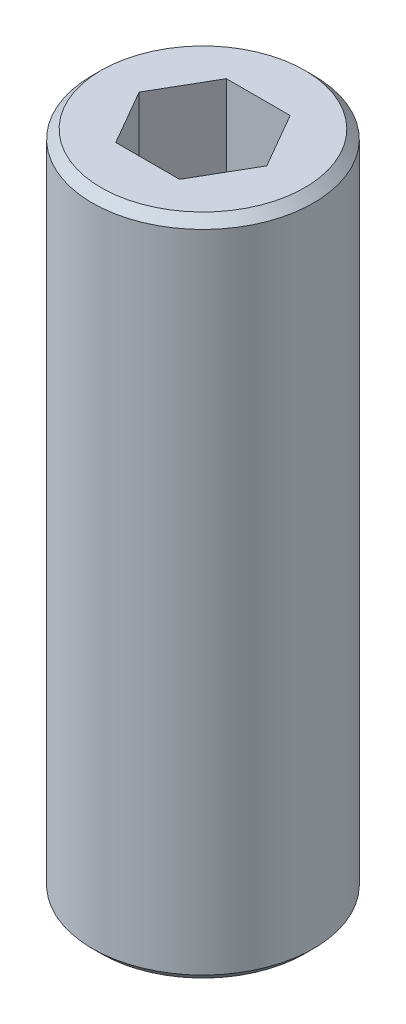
ISO-10303-21;
HEADER;
FILE_DESCRIPTION(('STEP AP214'),'2;1');
FILE_NAME('part.step','',(''),(''),'','','');
FILE_SCHEMA(('AUTOMOTIVE_DESIGN { 1 0 10303 214 1 1 1 1 }'));
ENDSEC;
DATA;
#1=APPLICATION_CONTEXT('core data for automotive mechanical design processes');
#2=APPLICATION_PROTOCOL_DEFINITION('international standard','automotive_design',2000,#1);
#3=PRODUCT_CONTEXT('',#1,'mechanical');
#4=PRODUCT('Part','Part','',(#3));
#5=PRODUCT_RELATED_PRODUCT_CATEGORY('part','',(#4));
#6=PRODUCT_DEFINITION_FORMATION('','',#4);
#7=PRODUCT_DEFINITION_CONTEXT('part definition',#1,'design');
#8=PRODUCT_DEFINITION('design','',#6,#7);
#9=PRODUCT_DEFINITION_SHAPE('','',#8);
#10=(LENGTH_UNIT() NAMED_UNIT(*) SI_UNIT(.MILLI.,.METRE.));
#11=(NAMED_UNIT(*) PLANE_ANGLE_UNIT() SI_UNIT($,.RADIAN.));
#12=(NAMED_UNIT(*) SI_UNIT($,.STERADIAN.) SOLID_ANGLE_UNIT());
#13=UNCERTAINTY_MEASURE_WITH_UNIT(LENGTH_MEASURE(1.E-05),#10,'distance_accuracy_value','');
#14=(GEOMETRIC_REPRESENTATION_CONTEXT(3) GLOBAL_UNCERTAINTY_ASSIGNED_CONTEXT((#13)) GLOBAL_UNIT_ASSIGNED_CONTEXT((#10,
#11,#12)) REPRESENTATION_CONTEXT('',''));
#15=CARTESIAN_POINT('',(0.,0.,0.));
#16=DIRECTION('',(0.,0.,1.));
#17=DIRECTION('',(1.,0.,0.));
#18=AXIS2_PLACEMENT_3D('',#15,#16,#17);
#19=CARTESIAN_POINT('',(0.,-19.05,0.));
#20=DIRECTION('',(0.,-1.,0.));
#21=DIRECTION('',(1.,0.,0.));
#22=AXIS2_PLACEMENT_3D('',#19,#20,#21);
#23=CONICAL_SURFACE('',#22,2.921,1.48352986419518);
#24=CARTESIAN_POINT('',(0.,-18.7944456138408,0.));
#25=VERTEX_POINT('',#24);
#26=VERTEX_LOOP('',#25);
#27=FACE_BOUND('',#26,.T.);
#28=CARTESIAN_POINT('',(0.,-19.05,0.));
#29=DIRECTION('',(0.,1.,0.));
#30=DIRECTION('',(-1.,0.,0.));
#31=AXIS2_PLACEMENT_3D('',#28,#29,#30);
#32=CIRCLE('',#31,2.921);
#33=CARTESIAN_POINT('',(-2.921,-19.05,0.));
#34=VERTEX_POINT('',#33);
#35=EDGE_CURVE('E11',#34,#34,#32,.T.);
#36=ORIENTED_EDGE('',*,*,#35,.F.);
#37=EDGE_LOOP('',(#36));
#38=FACE_BOUND('',#37,.T.);
#39=ADVANCED_FACE('F37',(#27,#38),#23,.F.);
#40=CARTESIAN_POINT('',(0.,-18.796,0.));
#41=DIRECTION('',(0.,1.,0.));
#42=DIRECTION('',(-1.,0.,0.));
#43=AXIS2_PLACEMENT_3D('',#40,#41,#42);
#44=CONICAL_SURFACE('',#43,3.175,0.785398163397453);
#45=ORIENTED_EDGE('',*,*,#35,.T.);
#46=EDGE_LOOP('',(#45));
#47=FACE_BOUND('',#46,.T.);
#48=CARTESIAN_POINT('',(0.,-18.796,0.));
#49=DIRECTION('',(0.,1.,0.));
#50=DIRECTION('',(-1.,0.,0.));
#51=AXIS2_PLACEMENT_3D('',#48,#49,#50);
#52=CIRCLE('',#51,3.175);
#53=CARTESIAN_POINT('',(-3.175,-18.796,0.));
#54=VERTEX_POINT('',#53);
#55=EDGE_CURVE('E44',#54,#54,#52,.T.);
#56=ORIENTED_EDGE('',*,*,#55,.F.);
#57=EDGE_LOOP('',(#56));
#58=FACE_BOUND('',#57,.T.);
#59=ADVANCED_FACE('F154',(#47,#58),#44,.T.);
#60=CARTESIAN_POINT('',(0.,0.,0.));
#61=DIRECTION('',(0.,1.,0.));
#62=DIRECTION('',(-1.,0.,0.));
#63=AXIS2_PLACEMENT_3D('',#60,#61,#62);
#64=CYLINDRICAL_SURFACE('',#63,3.175);
#65=ORIENTED_EDGE('',*,*,#55,.T.);
#66=EDGE_LOOP('',(#65));
#67=FACE_BOUND('',#66,.T.);
#68=CARTESIAN_POINT('',(0.,-0.254000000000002,0.));
#69=DIRECTION('',(0.,1.,0.));
#70=DIRECTION('',(-1.,0.,0.));
#71=AXIS2_PLACEMENT_3D('',#68,#69,#70);
#72=CIRCLE('',#71,3.175);
#73=CARTESIAN_POINT('',(-3.175,-0.254000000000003,0.));
#74=VERTEX_POINT('',#73);
#75=EDGE_CURVE('E146',#74,#74,#72,.T.);
#76=ORIENTED_EDGE('',*,*,#75,.F.);
#77=EDGE_LOOP('',(#76));
#78=FACE_BOUND('',#77,.T.);
#79=ADVANCED_FACE('F151',(#67,#78),#64,.T.);
#80=CARTESIAN_POINT('',(0.,0.,0.));
#81=DIRECTION('',(0.,-1.,0.));
#82=DIRECTION('',(1.,0.,0.));
#83=AXIS2_PLACEMENT_3D('',#80,#81,#82);
#84=CONICAL_SURFACE('',#83,2.921,0.785398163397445);
#85=ORIENTED_EDGE('',*,*,#75,.T.);
#86=EDGE_LOOP('',(#85));
#87=FACE_BOUND('',#86,.T.);
#88=CARTESIAN_POINT('',(0.,0.,0.));
#89=DIRECTION('',(0.,1.,0.));
#90=DIRECTION('',(-1.,0.,0.));
#91=AXIS2_PLACEMENT_3D('',#88,#89,#90);
#92=CIRCLE('',#91,2.921);
#93=CARTESIAN_POINT('',(-2.921,0.,0.));
#94=VERTEX_POINT('',#93);
#95=EDGE_CURVE('E136',#94,#94,#92,.T.);
#96=ORIENTED_EDGE('',*,*,#95,.F.);
#97=EDGE_LOOP('',(#96));
#98=FACE_BOUND('',#97,.T.);
#99=ADVANCED_FACE('F161',(#87,#98),#84,.T.);
#100=CARTESIAN_POINT('',(0.,0.,0.));
#101=DIRECTION('',(0.,1.,0.));
#102=DIRECTION('',(-1.,0.,0.));
#103=AXIS2_PLACEMENT_3D('',#100,#101,#102);
#104=PLANE('',#103);
#105=DIRECTION('',(0.5,0.,0.866025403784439));
#106=VECTOR('',#105,1.);
#107=CARTESIAN_POINT('',(-1.83308710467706,0.,0.));
#108=LINE('',#107,#106);
#109=CARTESIAN_POINT('',(-1.83308710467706,0.,0.));
#110=VERTEX_POINT('',#109);
#111=CARTESIAN_POINT('',(-0.916543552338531,0.,1.5875));
#112=VERTEX_POINT('',#111);
#113=EDGE_CURVE('E51',#110,#112,#108,.T.);
#114=ORIENTED_EDGE('',*,*,#113,.F.);
#115=DIRECTION('',(-0.5,0.,0.866025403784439));
#116=VECTOR('',#115,1.);
#117=CARTESIAN_POINT('',(-0.916543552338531,0.,-1.5875));
#118=LINE('',#117,#116);
#119=CARTESIAN_POINT('',(-0.916543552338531,0.,-1.5875));
#120=VERTEX_POINT('',#119);
#121=EDGE_CURVE('E110',#120,#110,#118,.T.);
#122=ORIENTED_EDGE('',*,*,#121,.F.);
#123=DIRECTION('',(-1.,0.,0.));
#124=VECTOR('',#123,1.);
#125=CARTESIAN_POINT('',(0.916543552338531,0.,-1.5875));
#126=LINE('',#125,#124);
#127=CARTESIAN_POINT('',(0.916543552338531,0.,-1.5875));
#128=VERTEX_POINT('',#127);
#129=EDGE_CURVE('E113',#128,#120,#126,.T.);
#130=ORIENTED_EDGE('',*,*,#129,.F.);
#131=DIRECTION('',(-0.5,0.,-0.866025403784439));
#132=VECTOR('',#131,1.);
#133=CARTESIAN_POINT('',(1.83308710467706,0.,0.));
#134=LINE('',#133,#132);
#135=CARTESIAN_POINT('',(1.83308710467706,0.,0.));
#136=VERTEX_POINT('',#135);
#137=EDGE_CURVE('E129',#136,#128,#134,.T.);
#138=ORIENTED_EDGE('',*,*,#137,.F.);
#139=DIRECTION('',(0.5,0.,-0.866025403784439));
#140=VECTOR('',#139,1.);
#141=CARTESIAN_POINT('',(0.916543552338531,0.,1.5875));
#142=LINE('',#141,#140);
#143=CARTESIAN_POINT('',(0.916543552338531,0.,1.5875));
#144=VERTEX_POINT('',#143);
#145=EDGE_CURVE('E126',#144,#136,#142,.T.);
#146=ORIENTED_EDGE('',*,*,#145,.F.);
#147=DIRECTION('',(1.,0.,0.));
#148=VECTOR('',#147,1.);
#149=CARTESIAN_POINT('',(-0.916543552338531,0.,1.5875));
#150=LINE('',#149,#148);
#151=EDGE_CURVE('E124',#112,#144,#150,.T.);
#152=ORIENTED_EDGE('',*,*,#151,.F.);
#153=EDGE_LOOP('',(#114,#122,#130,#138,#146,#152));
#154=FACE_BOUND('',#153,.T.);
#155=ORIENTED_EDGE('',*,*,#95,.T.);
#156=EDGE_LOOP('',(#155));
#157=FACE_BOUND('',#156,.T.);
#158=ADVANCED_FACE('F166',(#154,#157),#104,.T.);
#159=CARTESIAN_POINT('',(-1.83308710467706,-2.54,0.));
#160=DIRECTION('',(-0.866025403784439,0.,0.5));
#161=DIRECTION('',(0.5,0.,0.866025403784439));
#162=AXIS2_PLACEMENT_3D('',#159,#160,#161);
#163=PLANE('',#162);
#164=ORIENTED_EDGE('',*,*,#113,.T.);
#165=DIRECTION('',(0.,1.,0.));
#166=VECTOR('',#165,1.);
#167=CARTESIAN_POINT('',(-0.916543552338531,-2.54,1.5875));
#168=LINE('',#167,#166);
#169=CARTESIAN_POINT('',(-0.916543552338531,-2.54,1.5875));
#170=VERTEX_POINT('',#169);
#171=EDGE_CURVE('E87',#170,#112,#168,.T.);
#172=ORIENTED_EDGE('',*,*,#171,.F.);
#173=DIRECTION('',(0.5,0.,0.866025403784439));
#174=VECTOR('',#173,1.);
#175=CARTESIAN_POINT('',(-1.83308710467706,-2.54,0.));
#176=LINE('',#175,#174);
#177=CARTESIAN_POINT('',(-1.83308710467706,-2.54,0.));
#178=VERTEX_POINT('',#177);
#179=EDGE_CURVE('E91',#178,#170,#176,.T.);
#180=ORIENTED_EDGE('',*,*,#179,.F.);
#181=DIRECTION('',(0.,1.,0.));
#182=VECTOR('',#181,1.);
#183=CARTESIAN_POINT('',(-1.83308710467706,-2.54,0.));
#184=LINE('',#183,#182);
#185=EDGE_CURVE('E134',#178,#110,#184,.T.);
#186=ORIENTED_EDGE('',*,*,#185,.T.);
#187=EDGE_LOOP('',(#164,#172,#180,#186));
#188=FACE_BOUND('',#187,.T.);
#189=ADVANCED_FACE('F89',(#188),#163,.F.);
#190=CARTESIAN_POINT('',(-0.916543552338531,-2.54,-1.5875));
#191=DIRECTION('',(-0.866025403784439,0.,-0.5));
#192=DIRECTION('',(-0.5,0.,0.866025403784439));
#193=AXIS2_PLACEMENT_3D('',#190,#191,#192);
#194=PLANE('',#193);
#195=ORIENTED_EDGE('',*,*,#121,.T.);
#196=ORIENTED_EDGE('',*,*,#185,.F.);
#197=DIRECTION('',(-0.5,0.,0.866025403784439));
#198=VECTOR('',#197,1.);
#199=CARTESIAN_POINT('',(-0.916543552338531,-2.54,-1.5875));
#200=LINE('',#199,#198);
#201=CARTESIAN_POINT('',(-0.916543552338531,-2.54,-1.5875));
#202=VERTEX_POINT('',#201);
#203=EDGE_CURVE('E97',#202,#178,#200,.T.);
#204=ORIENTED_EDGE('',*,*,#203,.F.);
#205=DIRECTION('',(0.,1.,0.));
#206=VECTOR('',#205,1.);
#207=CARTESIAN_POINT('',(-0.916543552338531,-2.54,-1.5875));
#208=LINE('',#207,#206);
#209=EDGE_CURVE('E137',#202,#120,#208,.T.);
#210=ORIENTED_EDGE('',*,*,#209,.T.);
#211=EDGE_LOOP('',(#195,#196,#204,#210));
#212=FACE_BOUND('',#211,.T.);
#213=ADVANCED_FACE('F173',(#212),#194,.F.);
#214=CARTESIAN_POINT('',(0.916543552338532,-2.54,-1.5875));
#215=DIRECTION('',(0.,0.,-1.));
#216=DIRECTION('',(-1.,0.,0.));
#217=AXIS2_PLACEMENT_3D('',#214,#215,#216);
#218=PLANE('',#217);
#219=ORIENTED_EDGE('',*,*,#129,.T.);
#220=ORIENTED_EDGE('',*,*,#209,.F.);
#221=DIRECTION('',(-1.,0.,0.));
#222=VECTOR('',#221,1.);
#223=CARTESIAN_POINT('',(0.916543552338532,-2.54,-1.5875));
#224=LINE('',#223,#222);
#225=CARTESIAN_POINT('',(0.916543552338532,-2.54,-1.5875));
#226=VERTEX_POINT('',#225);
#227=EDGE_CURVE('E120',#226,#202,#224,.T.);
#228=ORIENTED_EDGE('',*,*,#227,.F.);
#229=DIRECTION('',(0.,1.,0.));
#230=VECTOR('',#229,1.);
#231=CARTESIAN_POINT('',(0.916543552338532,-2.54,-1.5875));
#232=LINE('',#231,#230);
#233=EDGE_CURVE('E139',#226,#128,#232,.T.);
#234=ORIENTED_EDGE('',*,*,#233,.T.);
#235=EDGE_LOOP('',(#219,#220,#228,#234));
#236=FACE_BOUND('',#235,.T.);
#237=ADVANCED_FACE('F183',(#236),#218,.F.);
#238=CARTESIAN_POINT('',(1.83308710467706,-2.54,0.));
#239=DIRECTION('',(0.866025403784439,0.,-0.5));
#240=DIRECTION('',(-0.5,0.,-0.866025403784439));
#241=AXIS2_PLACEMENT_3D('',#238,#239,#240);
#242=PLANE('',#241);
#243=ORIENTED_EDGE('',*,*,#137,.T.);
#244=ORIENTED_EDGE('',*,*,#233,.F.);
#245=DIRECTION('',(-0.5,0.,-0.866025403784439));
#246=VECTOR('',#245,1.);
#247=CARTESIAN_POINT('',(1.83308710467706,-2.54,0.));
#248=LINE('',#247,#246);
#249=CARTESIAN_POINT('',(1.83308710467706,-2.54,0.));
#250=VERTEX_POINT('',#249);
#251=EDGE_CURVE('E117',#250,#226,#248,.T.);
#252=ORIENTED_EDGE('',*,*,#251,.F.);
#253=DIRECTION('',(0.,1.,0.));
#254=VECTOR('',#253,1.);
#255=CARTESIAN_POINT('',(1.83308710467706,-2.54,0.));
#256=LINE('',#255,#254);
#257=EDGE_CURVE('E141',#250,#136,#256,.T.);
#258=ORIENTED_EDGE('',*,*,#257,.T.);
#259=EDGE_LOOP('',(#243,#244,#252,#258));
#260=FACE_BOUND('',#259,.T.);
#261=ADVANCED_FACE('F179',(#260),#242,.F.);
#262=CARTESIAN_POINT('',(0.916543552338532,-2.54,1.5875));
#263=DIRECTION('',(0.866025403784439,0.,0.5));
#264=DIRECTION('',(0.5,0.,-0.866025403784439));
#265=AXIS2_PLACEMENT_3D('',#262,#263,#264);
#266=PLANE('',#265);
#267=ORIENTED_EDGE('',*,*,#145,.T.);
#268=ORIENTED_EDGE('',*,*,#257,.F.);
#269=DIRECTION('',(0.5,0.,-0.866025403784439));
#270=VECTOR('',#269,1.);
#271=CARTESIAN_POINT('',(0.916543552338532,-2.54,1.5875));
#272=LINE('',#271,#270);
#273=CARTESIAN_POINT('',(0.916543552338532,-2.54,1.5875));
#274=VERTEX_POINT('',#273);
#275=EDGE_CURVE('E105',#274,#250,#272,.T.);
#276=ORIENTED_EDGE('',*,*,#275,.F.);
#277=DIRECTION('',(0.,1.,0.));
#278=VECTOR('',#277,1.);
#279=CARTESIAN_POINT('',(0.916543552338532,-2.54,1.5875));
#280=LINE('',#279,#278);
#281=EDGE_CURVE('E96',#274,#144,#280,.T.);
#282=ORIENTED_EDGE('',*,*,#281,.T.);
#283=EDGE_LOOP('',(#267,#268,#276,#282));
#284=FACE_BOUND('',#283,.T.);
#285=ADVANCED_FACE('F176',(#284),#266,.F.);
#286=CARTESIAN_POINT('',(-0.916543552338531,-2.54,1.5875));
#287=DIRECTION('',(0.,0.,1.));
#288=DIRECTION('',(1.,0.,0.));
#289=AXIS2_PLACEMENT_3D('',#286,#287,#288);
#290=PLANE('',#289);
#291=ORIENTED_EDGE('',*,*,#151,.T.);
#292=ORIENTED_EDGE('',*,*,#281,.F.);
#293=DIRECTION('',(1.,0.,0.));
#294=VECTOR('',#293,1.);
#295=CARTESIAN_POINT('',(-0.916543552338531,-2.54,1.5875));
#296=LINE('',#295,#294);
#297=EDGE_CURVE('E100',#170,#274,#296,.T.);
#298=ORIENTED_EDGE('',*,*,#297,.F.);
#299=ORIENTED_EDGE('',*,*,#171,.T.);
#300=EDGE_LOOP('',(#291,#292,#298,#299));
#301=FACE_BOUND('',#300,.T.);
#302=ADVANCED_FACE('F101',(#301),#290,.F.);
#303=CARTESIAN_POINT('',(0.,-2.54,0.));
#304=DIRECTION('',(0.,1.,0.));
#305=DIRECTION('',(-1.,0.,0.));
#306=AXIS2_PLACEMENT_3D('',#303,#304,#305);
#307=PLANE('',#306);
#308=ORIENTED_EDGE('',*,*,#179,.T.);
#309=ORIENTED_EDGE('',*,*,#297,.T.);
#310=ORIENTED_EDGE('',*,*,#275,.T.);
#311=ORIENTED_EDGE('',*,*,#251,.T.);
#312=ORIENTED_EDGE('',*,*,#227,.T.);
#313=ORIENTED_EDGE('',*,*,#203,.T.);
#314=EDGE_LOOP('',(#308,#309,#310,#311,#312,#313));
#315=FACE_BOUND('',#314,.T.);
#316=ADVANCED_FACE('F107',(#315),#307,.T.);
#317=CLOSED_SHELL('',(#39,#59,#79,#99,#158,#189,#213,#237,#261,#285,#302,#316));
#318=MANIFOLD_SOLID_BREP('B2',#317);
#319=ADVANCED_BREP_SHAPE_REPRESENTATION('',(#18,#318),#14);
#320=SHAPE_DEFINITION_REPRESENTATION(#9,#319);
ENDSEC;
END-ISO-10303-21;
